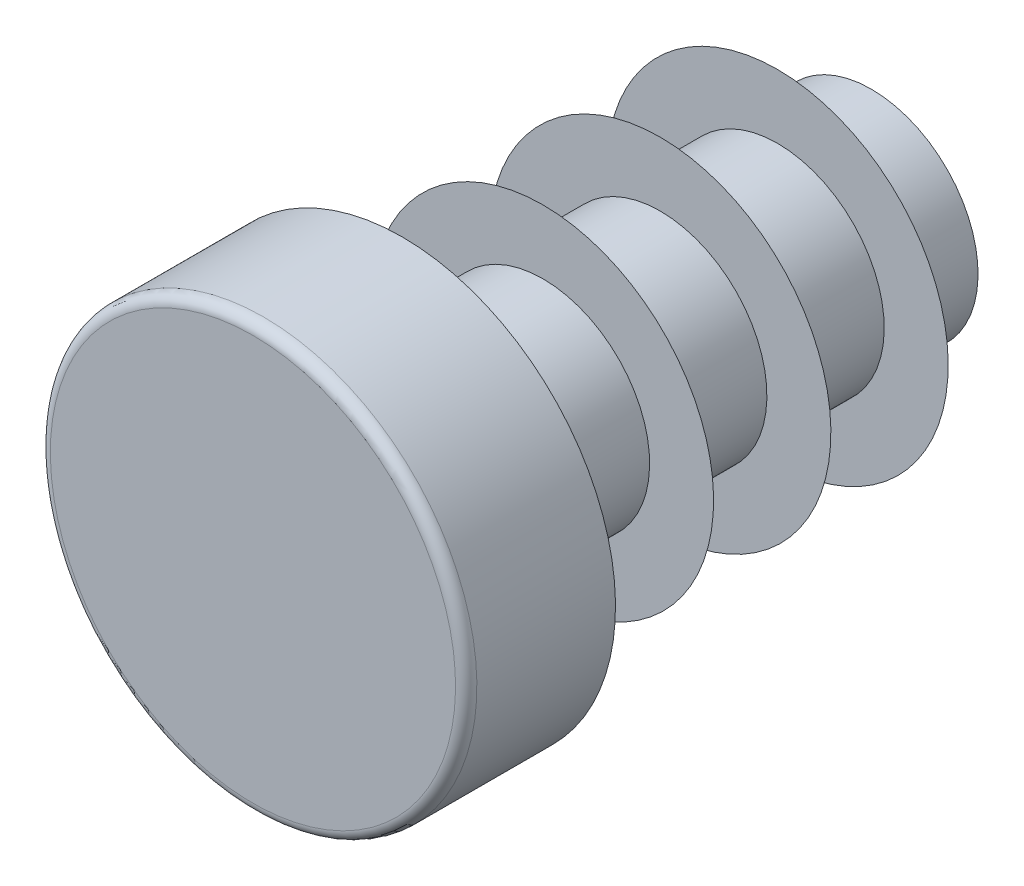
ISO-10303-21;
HEADER;
FILE_DESCRIPTION(('STEP AP214'),'2;1');
FILE_NAME('part.step','',(''),(''),'','','');
FILE_SCHEMA(('AUTOMOTIVE_DESIGN { 1 0 10303 214 1 1 1 1 }'));
ENDSEC;
DATA;
#1=APPLICATION_CONTEXT('core data for automotive mechanical design processes');
#2=APPLICATION_PROTOCOL_DEFINITION('international standard','automotive_design',2000,#1);
#3=PRODUCT_CONTEXT('',#1,'mechanical');
#4=PRODUCT('Part','Part','',(#3));
#5=PRODUCT_RELATED_PRODUCT_CATEGORY('part','',(#4));
#6=PRODUCT_DEFINITION_FORMATION('','',#4);
#7=PRODUCT_DEFINITION_CONTEXT('part definition',#1,'design');
#8=PRODUCT_DEFINITION('design','',#6,#7);
#9=PRODUCT_DEFINITION_SHAPE('','',#8);
#10=(LENGTH_UNIT() NAMED_UNIT(*) SI_UNIT(.MILLI.,.METRE.));
#11=(NAMED_UNIT(*) PLANE_ANGLE_UNIT() SI_UNIT($,.RADIAN.));
#12=(NAMED_UNIT(*) SI_UNIT($,.STERADIAN.) SOLID_ANGLE_UNIT());
#13=UNCERTAINTY_MEASURE_WITH_UNIT(LENGTH_MEASURE(1.E-05),#10,'distance_accuracy_value','');
#14=(GEOMETRIC_REPRESENTATION_CONTEXT(3) GLOBAL_UNCERTAINTY_ASSIGNED_CONTEXT((#13)) GLOBAL_UNIT_ASSIGNED_CONTEXT((#10,
#11,#12)) REPRESENTATION_CONTEXT('',''));
#15=CARTESIAN_POINT('',(0.,0.,0.));
#16=DIRECTION('',(0.,0.,1.));
#17=DIRECTION('',(1.,0.,0.));
#18=AXIS2_PLACEMENT_3D('',#15,#16,#17);
#19=CARTESIAN_POINT('',(0.,0.,3.5));
#20=DIRECTION('',(0.,0.,-1.));
#21=DIRECTION('',(0.,1.,0.));
#22=AXIS2_PLACEMENT_3D('',#19,#20,#21);
#23=PLANE('',#22);
#24=CARTESIAN_POINT('',(0.,0.,3.5));
#25=DIRECTION('',(0.,0.,-1.));
#26=DIRECTION('',(0.,1.,0.));
#27=AXIS2_PLACEMENT_3D('',#24,#25,#26);
#28=CIRCLE('',#27,4.75);
#29=CARTESIAN_POINT('',(0.,4.75,3.5));
#30=VERTEX_POINT('',#29);
#31=EDGE_CURVE('E8',#30,#30,#28,.T.);
#32=ORIENTED_EDGE('',*,*,#31,.F.);
#33=EDGE_LOOP('',(#32));
#34=FACE_BOUND('',#33,.T.);
#35=ADVANCED_FACE('F12',(#34),#23,.F.);
#36=CARTESIAN_POINT('',(0.,0.,3.25));
#37=DIRECTION('',(0.,0.,-1.));
#38=DIRECTION('',(0.,1.,0.));
#39=AXIS2_PLACEMENT_3D('',#36,#37,#38);
#40=TOROIDAL_SURFACE('',#39,4.75,0.25);
#41=ORIENTED_EDGE('',*,*,#31,.T.);
#42=EDGE_LOOP('',(#41));
#43=FACE_BOUND('',#42,.T.);
#44=CARTESIAN_POINT('',(0.,0.,3.25));
#45=DIRECTION('',(0.,0.,-1.));
#46=DIRECTION('',(0.,1.,0.));
#47=AXIS2_PLACEMENT_3D('',#44,#45,#46);
#48=CIRCLE('',#47,5.);
#49=CARTESIAN_POINT('',(0.,5.,3.25));
#50=VERTEX_POINT('',#49);
#51=EDGE_CURVE('E18',#50,#50,#48,.T.);
#52=ORIENTED_EDGE('',*,*,#51,.F.);
#53=EDGE_LOOP('',(#52));
#54=FACE_BOUND('',#53,.T.);
#55=ADVANCED_FACE('F159',(#43,#54),#40,.T.);
#56=CARTESIAN_POINT('',(0.,0.,-11.));
#57=DIRECTION('',(0.,0.,-1.));
#58=DIRECTION('',(0.,1.,0.));
#59=AXIS2_PLACEMENT_3D('',#56,#57,#58);
#60=CYLINDRICAL_SURFACE('',#59,5.);
#61=CARTESIAN_POINT('',(0.,0.,0.));
#62=DIRECTION('',(0.,0.,-1.));
#63=DIRECTION('',(0.,1.,0.));
#64=AXIS2_PLACEMENT_3D('',#61,#62,#63);
#65=CIRCLE('',#64,5.);
#66=CARTESIAN_POINT('',(0.,5.,0.));
#67=VERTEX_POINT('',#66);
#68=EDGE_CURVE('E22',#67,#67,#65,.T.);
#69=ORIENTED_EDGE('',*,*,#68,.F.);
#70=EDGE_LOOP('',(#69));
#71=FACE_BOUND('',#70,.T.);
#72=ORIENTED_EDGE('',*,*,#51,.T.);
#73=EDGE_LOOP('',(#72));
#74=FACE_BOUND('',#73,.T.);
#75=ADVANCED_FACE('F154',(#71,#74),#60,.T.);
#76=CARTESIAN_POINT('',(5.,0.,0.));
#77=DIRECTION('',(0.,0.,1.));
#78=DIRECTION('',(0.,-1.,0.));
#79=AXIS2_PLACEMENT_3D('',#76,#77,#78);
#80=PLANE('',#79);
#81=CARTESIAN_POINT('',(0.,0.,0.));
#82=DIRECTION('',(0.,0.,-1.));
#83=DIRECTION('',(0.,1.,0.));
#84=AXIS2_PLACEMENT_3D('',#81,#82,#83);
#85=CIRCLE('',#84,2.5);
#86=CARTESIAN_POINT('',(0.,2.5,0.));
#87=VERTEX_POINT('',#86);
#88=EDGE_CURVE('E26',#87,#87,#85,.T.);
#89=ORIENTED_EDGE('',*,*,#88,.F.);
#90=EDGE_LOOP('',(#89));
#91=FACE_BOUND('',#90,.T.);
#92=ORIENTED_EDGE('',*,*,#68,.T.);
#93=EDGE_LOOP('',(#92));
#94=FACE_BOUND('',#93,.T.);
#95=ADVANCED_FACE('F148',(#91,#94),#80,.F.);
#96=CARTESIAN_POINT('',(0.,0.,-11.));
#97=DIRECTION('',(0.,0.,-1.));
#98=DIRECTION('',(0.,1.,0.));
#99=AXIS2_PLACEMENT_3D('',#96,#97,#98);
#100=CYLINDRICAL_SURFACE('',#99,2.5);
#101=CARTESIAN_POINT('',(0.,0.,-0.55));
#102=DIRECTION('',(0.,0.,-1.));
#103=DIRECTION('',(0.,1.,0.));
#104=AXIS2_PLACEMENT_3D('',#101,#102,#103);
#105=CIRCLE('',#104,2.5);
#106=CARTESIAN_POINT('',(0.,2.5,-0.55));
#107=VERTEX_POINT('',#106);
#108=EDGE_CURVE('E31',#107,#107,#105,.T.);
#109=ORIENTED_EDGE('',*,*,#108,.F.);
#110=EDGE_LOOP('',(#109));
#111=FACE_BOUND('',#110,.T.);
#112=ORIENTED_EDGE('',*,*,#88,.T.);
#113=EDGE_LOOP('',(#112));
#114=FACE_BOUND('',#113,.T.);
#115=ADVANCED_FACE('F142',(#111,#114),#100,.T.);
#116=CARTESIAN_POINT('',(2.5,0.,-0.55));
#117=DIRECTION('',(0.,0.,-1.));
#118=DIRECTION('',(0.,1.,0.));
#119=AXIS2_PLACEMENT_3D('',#116,#117,#118);
#120=PLANE('',#119);
#121=CARTESIAN_POINT('',(0.,0.,-0.55));
#122=DIRECTION('',(0.,0.,-1.));
#123=DIRECTION('',(0.,1.,0.));
#124=AXIS2_PLACEMENT_3D('',#121,#122,#123);
#125=CIRCLE('',#124,4.);
#126=CARTESIAN_POINT('',(0.,4.,-0.55));
#127=VERTEX_POINT('',#126);
#128=EDGE_CURVE('E34',#127,#127,#125,.T.);
#129=ORIENTED_EDGE('',*,*,#128,.F.);
#130=EDGE_LOOP('',(#129));
#131=FACE_BOUND('',#130,.T.);
#132=ORIENTED_EDGE('',*,*,#108,.T.);
#133=EDGE_LOOP('',(#132));
#134=FACE_BOUND('',#133,.T.);
#135=ADVANCED_FACE('F136',(#131,#134),#120,.F.);
#136=CARTESIAN_POINT('',(0.,0.,-0.55));
#137=DIRECTION('',(0.,0.,1.));
#138=DIRECTION('',(0.,-1.,0.));
#139=AXIS2_PLACEMENT_3D('',#136,#137,#138);
#140=CONICAL_SURFACE('',#139,4.,0.959931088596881);
#141=CARTESIAN_POINT('',(0.,0.,-1.60031130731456));
#142=DIRECTION('',(0.,0.,-1.));
#143=DIRECTION('',(0.,1.,0.));
#144=AXIS2_PLACEMENT_3D('',#141,#142,#143);
#145=CIRCLE('',#144,2.5);
#146=CARTESIAN_POINT('',(0.,2.5,-1.60031130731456));
#147=VERTEX_POINT('',#146);
#148=EDGE_CURVE('E37',#147,#147,#145,.T.);
#149=ORIENTED_EDGE('',*,*,#148,.F.);
#150=EDGE_LOOP('',(#149));
#151=FACE_BOUND('',#150,.T.);
#152=ORIENTED_EDGE('',*,*,#128,.T.);
#153=EDGE_LOOP('',(#152));
#154=FACE_BOUND('',#153,.T.);
#155=ADVANCED_FACE('F130',(#151,#154),#140,.T.);
#156=CARTESIAN_POINT('',(0.,0.,-11.));
#157=DIRECTION('',(0.,0.,-1.));
#158=DIRECTION('',(0.,1.,0.));
#159=AXIS2_PLACEMENT_3D('',#156,#157,#158);
#160=CYLINDRICAL_SURFACE('',#159,2.5);
#161=CARTESIAN_POINT('',(0.,0.,-3.3));
#162=DIRECTION('',(0.,0.,-1.));
#163=DIRECTION('',(0.,1.,0.));
#164=AXIS2_PLACEMENT_3D('',#161,#162,#163);
#165=CIRCLE('',#164,2.5);
#166=CARTESIAN_POINT('',(0.,2.5,-3.3));
#167=VERTEX_POINT('',#166);
#168=EDGE_CURVE('E40',#167,#167,#165,.T.);
#169=ORIENTED_EDGE('',*,*,#168,.F.);
#170=EDGE_LOOP('',(#169));
#171=FACE_BOUND('',#170,.T.);
#172=ORIENTED_EDGE('',*,*,#148,.T.);
#173=EDGE_LOOP('',(#172));
#174=FACE_BOUND('',#173,.T.);
#175=ADVANCED_FACE('F124',(#171,#174),#160,.T.);
#176=CARTESIAN_POINT('',(2.5,0.,-3.3));
#177=DIRECTION('',(0.,0.,-1.));
#178=DIRECTION('',(0.,1.,0.));
#179=AXIS2_PLACEMENT_3D('',#176,#177,#178);
#180=PLANE('',#179);
#181=CARTESIAN_POINT('',(0.,0.,-3.3));
#182=DIRECTION('',(0.,0.,-1.));
#183=DIRECTION('',(0.,1.,0.));
#184=AXIS2_PLACEMENT_3D('',#181,#182,#183);
#185=CIRCLE('',#184,4.);
#186=CARTESIAN_POINT('',(0.,4.,-3.3));
#187=VERTEX_POINT('',#186);
#188=EDGE_CURVE('E43',#187,#187,#185,.T.);
#189=ORIENTED_EDGE('',*,*,#188,.F.);
#190=EDGE_LOOP('',(#189));
#191=FACE_BOUND('',#190,.T.);
#192=ORIENTED_EDGE('',*,*,#168,.T.);
#193=EDGE_LOOP('',(#192));
#194=FACE_BOUND('',#193,.T.);
#195=ADVANCED_FACE('F118',(#191,#194),#180,.F.);
#196=CARTESIAN_POINT('',(0.,0.,-3.3));
#197=DIRECTION('',(0.,0.,1.));
#198=DIRECTION('',(0.,-1.,0.));
#199=AXIS2_PLACEMENT_3D('',#196,#197,#198);
#200=CONICAL_SURFACE('',#199,4.,0.959931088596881);
#201=CARTESIAN_POINT('',(0.,0.,-4.35031130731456));
#202=DIRECTION('',(0.,0.,-1.));
#203=DIRECTION('',(0.,1.,0.));
#204=AXIS2_PLACEMENT_3D('',#201,#202,#203);
#205=CIRCLE('',#204,2.5);
#206=CARTESIAN_POINT('',(0.,2.5,-4.35031130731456));
#207=VERTEX_POINT('',#206);
#208=EDGE_CURVE('E46',#207,#207,#205,.T.);
#209=ORIENTED_EDGE('',*,*,#208,.F.);
#210=EDGE_LOOP('',(#209));
#211=FACE_BOUND('',#210,.T.);
#212=ORIENTED_EDGE('',*,*,#188,.T.);
#213=EDGE_LOOP('',(#212));
#214=FACE_BOUND('',#213,.T.);
#215=ADVANCED_FACE('F112',(#211,#214),#200,.T.);
#216=CARTESIAN_POINT('',(0.,0.,-11.));
#217=DIRECTION('',(0.,0.,-1.));
#218=DIRECTION('',(0.,1.,0.));
#219=AXIS2_PLACEMENT_3D('',#216,#217,#218);
#220=CYLINDRICAL_SURFACE('',#219,2.5);
#221=CARTESIAN_POINT('',(0.,0.,-6.05));
#222=DIRECTION('',(0.,0.,-1.));
#223=DIRECTION('',(0.,1.,0.));
#224=AXIS2_PLACEMENT_3D('',#221,#222,#223);
#225=CIRCLE('',#224,2.5);
#226=CARTESIAN_POINT('',(0.,2.5,-6.05));
#227=VERTEX_POINT('',#226);
#228=EDGE_CURVE('E49',#227,#227,#225,.T.);
#229=ORIENTED_EDGE('',*,*,#228,.F.);
#230=EDGE_LOOP('',(#229));
#231=FACE_BOUND('',#230,.T.);
#232=ORIENTED_EDGE('',*,*,#208,.T.);
#233=EDGE_LOOP('',(#232));
#234=FACE_BOUND('',#233,.T.);
#235=ADVANCED_FACE('F106',(#231,#234),#220,.T.);
#236=CARTESIAN_POINT('',(2.5,0.,-6.05));
#237=DIRECTION('',(0.,0.,-1.));
#238=DIRECTION('',(0.,1.,0.));
#239=AXIS2_PLACEMENT_3D('',#236,#237,#238);
#240=PLANE('',#239);
#241=CARTESIAN_POINT('',(0.,0.,-6.05));
#242=DIRECTION('',(0.,0.,-1.));
#243=DIRECTION('',(0.,1.,0.));
#244=AXIS2_PLACEMENT_3D('',#241,#242,#243);
#245=CIRCLE('',#244,4.);
#246=CARTESIAN_POINT('',(0.,4.,-6.05));
#247=VERTEX_POINT('',#246);
#248=EDGE_CURVE('E52',#247,#247,#245,.T.);
#249=ORIENTED_EDGE('',*,*,#248,.F.);
#250=EDGE_LOOP('',(#249));
#251=FACE_BOUND('',#250,.T.);
#252=ORIENTED_EDGE('',*,*,#228,.T.);
#253=EDGE_LOOP('',(#252));
#254=FACE_BOUND('',#253,.T.);
#255=ADVANCED_FACE('F100',(#251,#254),#240,.F.);
#256=CARTESIAN_POINT('',(0.,0.,-6.05));
#257=DIRECTION('',(0.,0.,1.));
#258=DIRECTION('',(0.,-1.,0.));
#259=AXIS2_PLACEMENT_3D('',#256,#257,#258);
#260=CONICAL_SURFACE('',#259,4.,0.959931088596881);
#261=CARTESIAN_POINT('',(0.,0.,-7.10031130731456));
#262=DIRECTION('',(0.,0.,-1.));
#263=DIRECTION('',(0.,1.,0.));
#264=AXIS2_PLACEMENT_3D('',#261,#262,#263);
#265=CIRCLE('',#264,2.5);
#266=CARTESIAN_POINT('',(0.,2.5,-7.10031130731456));
#267=VERTEX_POINT('',#266);
#268=EDGE_CURVE('E55',#267,#267,#265,.T.);
#269=ORIENTED_EDGE('',*,*,#268,.F.);
#270=EDGE_LOOP('',(#269));
#271=FACE_BOUND('',#270,.T.);
#272=ORIENTED_EDGE('',*,*,#248,.T.);
#273=EDGE_LOOP('',(#272));
#274=FACE_BOUND('',#273,.T.);
#275=ADVANCED_FACE('F94',(#271,#274),#260,.T.);
#276=CARTESIAN_POINT('',(0.,0.,-11.));
#277=DIRECTION('',(0.,0.,-1.));
#278=DIRECTION('',(0.,1.,0.));
#279=AXIS2_PLACEMENT_3D('',#276,#277,#278);
#280=CYLINDRICAL_SURFACE('',#279,2.5);
#281=CARTESIAN_POINT('',(0.,0.,-8.8));
#282=DIRECTION('',(0.,0.,-1.));
#283=DIRECTION('',(0.,1.,0.));
#284=AXIS2_PLACEMENT_3D('',#281,#282,#283);
#285=CIRCLE('',#284,2.5);
#286=CARTESIAN_POINT('',(0.,2.5,-8.8));
#287=VERTEX_POINT('',#286);
#288=EDGE_CURVE('E58',#287,#287,#285,.T.);
#289=ORIENTED_EDGE('',*,*,#288,.F.);
#290=EDGE_LOOP('',(#289));
#291=FACE_BOUND('',#290,.T.);
#292=ORIENTED_EDGE('',*,*,#268,.T.);
#293=EDGE_LOOP('',(#292));
#294=FACE_BOUND('',#293,.T.);
#295=ADVANCED_FACE('F88',(#291,#294),#280,.T.);
#296=CARTESIAN_POINT('',(2.5,0.,-8.8));
#297=DIRECTION('',(0.,0.,-1.));
#298=DIRECTION('',(0.,1.,0.));
#299=AXIS2_PLACEMENT_3D('',#296,#297,#298);
#300=PLANE('',#299);
#301=CARTESIAN_POINT('',(0.,0.,-8.8));
#302=DIRECTION('',(0.,0.,-1.));
#303=DIRECTION('',(0.,1.,0.));
#304=AXIS2_PLACEMENT_3D('',#301,#302,#303);
#305=CIRCLE('',#304,4.);
#306=CARTESIAN_POINT('',(0.,4.,-8.8));
#307=VERTEX_POINT('',#306);
#308=EDGE_CURVE('E61',#307,#307,#305,.T.);
#309=ORIENTED_EDGE('',*,*,#308,.F.);
#310=EDGE_LOOP('',(#309));
#311=FACE_BOUND('',#310,.T.);
#312=ORIENTED_EDGE('',*,*,#288,.T.);
#313=EDGE_LOOP('',(#312));
#314=FACE_BOUND('',#313,.T.);
#315=ADVANCED_FACE('F82',(#311,#314),#300,.F.);
#316=CARTESIAN_POINT('',(0.,0.,-8.8));
#317=DIRECTION('',(0.,0.,1.));
#318=DIRECTION('',(0.,-1.,0.));
#319=AXIS2_PLACEMENT_3D('',#316,#317,#318);
#320=CONICAL_SURFACE('',#319,4.,0.95993108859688);
#321=CARTESIAN_POINT('',(0.,0.,-9.85031130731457));
#322=DIRECTION('',(0.,0.,-1.));
#323=DIRECTION('',(0.,1.,0.));
#324=AXIS2_PLACEMENT_3D('',#321,#322,#323);
#325=CIRCLE('',#324,2.5);
#326=CARTESIAN_POINT('',(0.,2.5,-9.85031130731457));
#327=VERTEX_POINT('',#326);
#328=EDGE_CURVE('E64',#327,#327,#325,.T.);
#329=ORIENTED_EDGE('',*,*,#328,.F.);
#330=EDGE_LOOP('',(#329));
#331=FACE_BOUND('',#330,.T.);
#332=ORIENTED_EDGE('',*,*,#308,.T.);
#333=EDGE_LOOP('',(#332));
#334=FACE_BOUND('',#333,.T.);
#335=ADVANCED_FACE('F76',(#331,#334),#320,.T.);
#336=CARTESIAN_POINT('',(0.,0.,-11.));
#337=DIRECTION('',(0.,0.,-1.));
#338=DIRECTION('',(0.,1.,0.));
#339=AXIS2_PLACEMENT_3D('',#336,#337,#338);
#340=CYLINDRICAL_SURFACE('',#339,2.5);
#341=CARTESIAN_POINT('',(0.,0.,-11.));
#342=DIRECTION('',(0.,0.,-1.));
#343=DIRECTION('',(0.,1.,0.));
#344=AXIS2_PLACEMENT_3D('',#341,#342,#343);
#345=CIRCLE('',#344,2.5);
#346=CARTESIAN_POINT('',(0.,2.5,-11.));
#347=VERTEX_POINT('',#346);
#348=EDGE_CURVE('E67',#347,#347,#345,.T.);
#349=ORIENTED_EDGE('',*,*,#348,.F.);
#350=EDGE_LOOP('',(#349));
#351=FACE_BOUND('',#350,.T.);
#352=ORIENTED_EDGE('',*,*,#328,.T.);
#353=EDGE_LOOP('',(#352));
#354=FACE_BOUND('',#353,.T.);
#355=ADVANCED_FACE('F73',(#351,#354),#340,.T.);
#356=CARTESIAN_POINT('',(2.5,0.,-11.));
#357=DIRECTION('',(0.,0.,1.));
#358=DIRECTION('',(0.,-1.,0.));
#359=AXIS2_PLACEMENT_3D('',#356,#357,#358);
#360=PLANE('',#359);
#361=ORIENTED_EDGE('',*,*,#348,.T.);
#362=EDGE_LOOP('',(#361));
#363=FACE_BOUND('',#362,.T.);
#364=ADVANCED_FACE('F71',(#363),#360,.F.);
#365=CLOSED_SHELL('',(#35,#55,#75,#95,#115,#135,#155,#175,#195,#215,#235,#255,#275,#295,#315,
#335,#355,#364));
#366=MANIFOLD_SOLID_BREP('B1',#365);
#367=ADVANCED_BREP_SHAPE_REPRESENTATION('',(#18,#366),#14);
#368=SHAPE_DEFINITION_REPRESENTATION(#9,#367);
ENDSEC;
END-ISO-10303-21;
